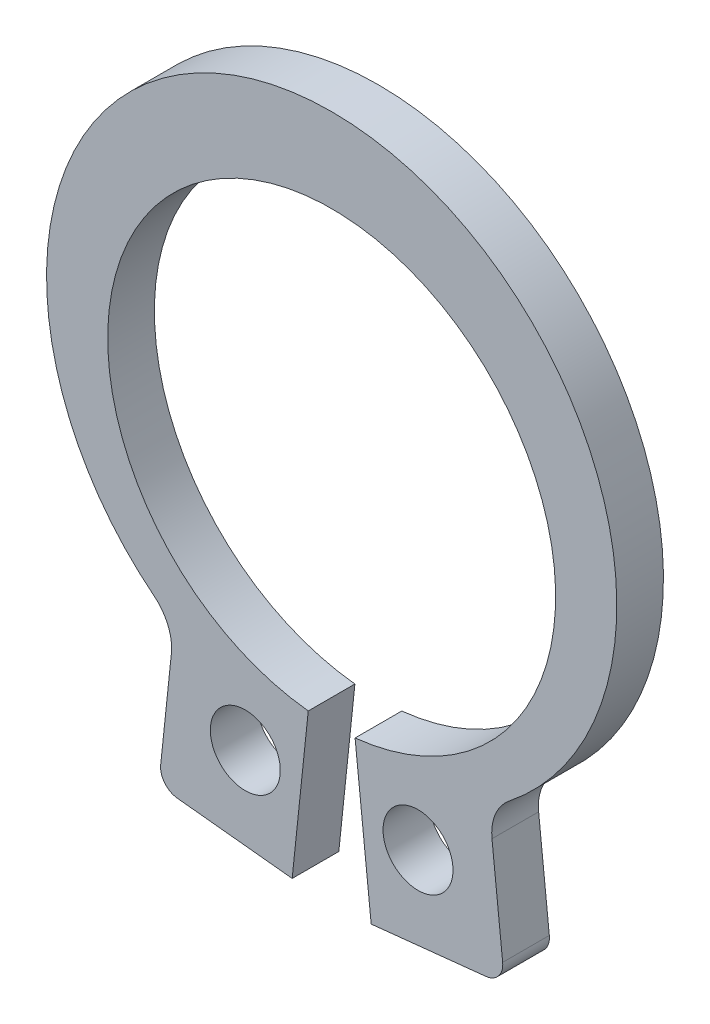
from build123d import *

# Parameters (mm, degrees)
BASE_EXTRUSION_DEPTH    = 1
ENL_V_MAT_EXTRU_1_DEPTH = 1
ENL_V_MAT_EXTRU_2_DEPTH = 1


with BuildPart() as part:
    # Esquisse1 → Base-Extrusion (new body)
    with BuildSketch(Plane.XY):
        with BuildLine():
            Line((-0.501736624, -4.773705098), (-0.846680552, -8.055627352))
            Line((-0.846680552, -8.055627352), (-3.308644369, -7.796864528))
            ThreePointArc((-3.308644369, -7.796864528), (-3.577691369, -7.650783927), (-3.664641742, -7.357244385))
            Line((-3.664641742, -7.357244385), (-3.435512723, -5.177227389))
            ThreePointArc((-3.435512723, -5.177227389), (-3.507710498, -4.686281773), (-3.807021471, -4.290487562))
            ThreePointArc((-3.807021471, -4.290487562), (0, 6.6), (3.807021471, -4.290487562))
            ThreePointArc((3.807021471, -4.290487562), (3.507710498, -4.686281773), (3.435512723, -5.177227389))
            Line((3.435512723, -5.177227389), (3.664641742, -7.357244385))
            ThreePointArc((3.664641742, -7.357244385), (3.577691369, -7.650783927), (3.308644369, -7.796864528))
            Line((3.308644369, -7.796864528), (0.846680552, -8.055627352))
            Line((0.846680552, -8.055627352), (0.501736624, -4.773705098))
            ThreePointArc((0.501736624, -4.773705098), (0, 4.8), (-0.501736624, -4.773705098))
        make_face()
    extrude(amount=BASE_EXTRUSION_DEPTH)

    # Esquisse2 → Enl_v. mat.-Extru.1 (cut)
    with BuildSketch(Plane.XY):
        with BuildLine():
            ThreePointArc((2.600774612, -6.17876471), (1.850774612, -6.92876471), (1.100774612, -6.17876471))
            ThreePointArc((1.100774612, -6.17876471), (1.850774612, -5.42876471), (2.600774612, -6.17876471))
        make_face()
    extrude(amount=ENL_V_MAT_EXTRU_1_DEPTH, mode=Mode.SUBTRACT)

    # Esquisse3 → Enl_v. mat.-Extru.2 (cut)
    with BuildSketch(Plane.XY):
        with BuildLine():
            ThreePointArc((-2.600774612, -6.17876471), (-1.850774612, -5.42876471), (-1.100774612, -6.17876471))
            ThreePointArc((-1.100774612, -6.17876471), (-1.850774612, -6.92876471), (-2.600774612, -6.17876471))
        make_face()
    extrude(amount=ENL_V_MAT_EXTRU_2_DEPTH, mode=Mode.SUBTRACT)


solid = part.part
